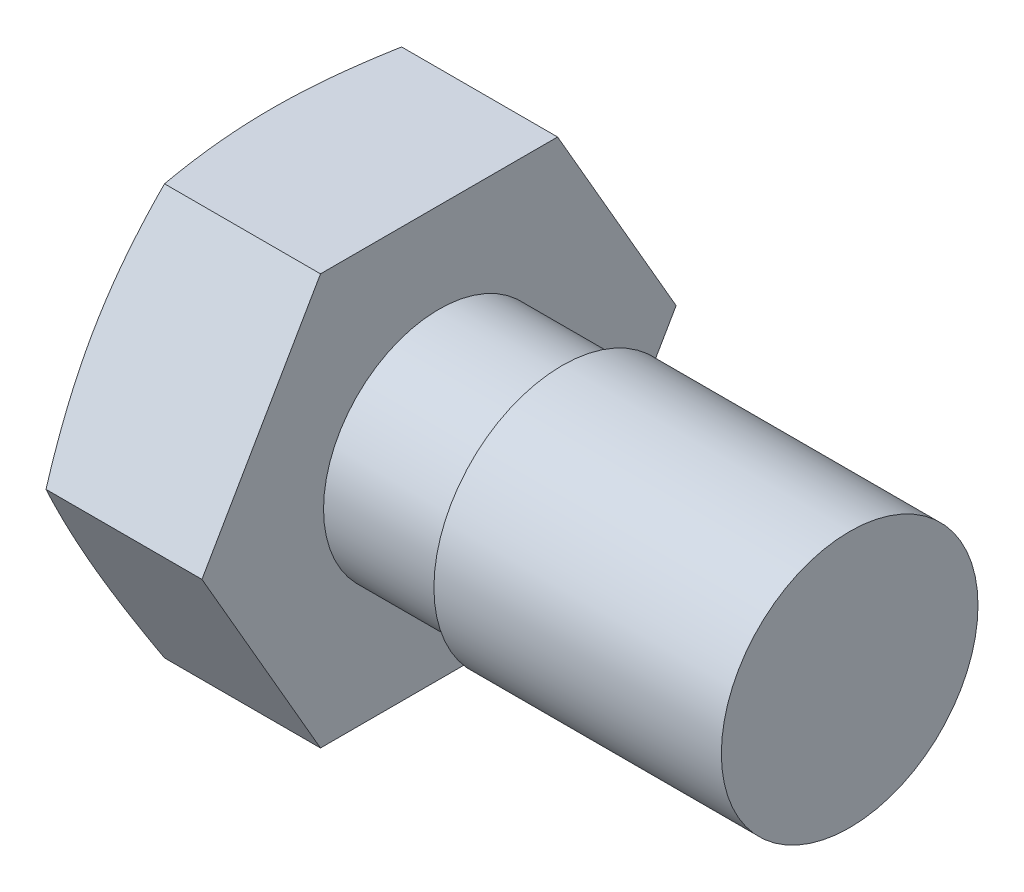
ISO-10303-21;
HEADER;
FILE_DESCRIPTION(('STEP AP214'),'2;1');
FILE_NAME('part.step','',(''),(''),'','','');
FILE_SCHEMA(('AUTOMOTIVE_DESIGN { 1 0 10303 214 1 1 1 1 }'));
ENDSEC;
DATA;
#1=APPLICATION_CONTEXT('core data for automotive mechanical design processes');
#2=APPLICATION_PROTOCOL_DEFINITION('international standard','automotive_design',2000,#1);
#3=PRODUCT_CONTEXT('',#1,'mechanical');
#4=PRODUCT('Part','Part','',(#3));
#5=PRODUCT_RELATED_PRODUCT_CATEGORY('part','',(#4));
#6=PRODUCT_DEFINITION_FORMATION('','',#4);
#7=PRODUCT_DEFINITION_CONTEXT('part definition',#1,'design');
#8=PRODUCT_DEFINITION('design','',#6,#7);
#9=PRODUCT_DEFINITION_SHAPE('','',#8);
#10=(LENGTH_UNIT() NAMED_UNIT(*) SI_UNIT(.MILLI.,.METRE.));
#11=(NAMED_UNIT(*) PLANE_ANGLE_UNIT() SI_UNIT($,.RADIAN.));
#12=(NAMED_UNIT(*) SI_UNIT($,.STERADIAN.) SOLID_ANGLE_UNIT());
#13=UNCERTAINTY_MEASURE_WITH_UNIT(LENGTH_MEASURE(1.E-05),#10,'distance_accuracy_value','');
#14=(GEOMETRIC_REPRESENTATION_CONTEXT(3) GLOBAL_UNCERTAINTY_ASSIGNED_CONTEXT((#13)) GLOBAL_UNIT_ASSIGNED_CONTEXT((#10,
#11,#12)) REPRESENTATION_CONTEXT('',''));
#15=CARTESIAN_POINT('',(0.,0.,0.));
#16=DIRECTION('',(0.,0.,1.));
#17=DIRECTION('',(1.,0.,0.));
#18=AXIS2_PLACEMENT_3D('',#15,#16,#17);
#19=CARTESIAN_POINT('',(1.2,0.,0.));
#20=DIRECTION('',(-1.,0.,0.));
#21=DIRECTION('',(0.,0.,1.));
#22=AXIS2_PLACEMENT_3D('',#19,#20,#21);
#23=PLANE('',#22);
#24=CARTESIAN_POINT('',(1.2,0.,0.));
#25=DIRECTION('',(-1.,0.,0.));
#26=DIRECTION('',(0.,0.,1.));
#27=AXIS2_PLACEMENT_3D('',#24,#25,#26);
#28=CIRCLE('',#27,3.35);
#29=CARTESIAN_POINT('',(1.2,0.,3.35));
#30=VERTEX_POINT('',#29);
#31=EDGE_CURVE('E231',#30,#30,#28,.T.);
#32=ORIENTED_EDGE('',*,*,#31,.T.);
#33=EDGE_LOOP('',(#32));
#34=FACE_BOUND('',#33,.T.);
#35=DIRECTION('',(0.,0.,-1.));
#36=VECTOR('',#35,1.);
#37=CARTESIAN_POINT('',(1.2,2.4,0.));
#38=LINE('',#37,#36);
#39=CARTESIAN_POINT('',(1.2,2.4,0.545999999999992));
#40=VERTEX_POINT('',#39);
#41=CARTESIAN_POINT('',(1.2,2.4,-0.546000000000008));
#42=VERTEX_POINT('',#41);
#43=EDGE_CURVE('E202',#40,#42,#38,.T.);
#44=ORIENTED_EDGE('',*,*,#43,.F.);
#45=DIRECTION('',(0.,-1.,0.));
#46=VECTOR('',#45,1.);
#47=CARTESIAN_POINT('',(1.2,0.,0.546));
#48=LINE('',#47,#46);
#49=CARTESIAN_POINT('',(1.2,0.546,0.545999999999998));
#50=VERTEX_POINT('',#49);
#51=EDGE_CURVE('E191',#40,#50,#48,.T.);
#52=ORIENTED_EDGE('',*,*,#51,.T.);
#53=DIRECTION('',(0.,0.,-1.));
#54=VECTOR('',#53,1.);
#55=CARTESIAN_POINT('',(1.2,0.546,0.));
#56=LINE('',#55,#54);
#57=CARTESIAN_POINT('',(1.2,0.546,2.4));
#58=VERTEX_POINT('',#57);
#59=EDGE_CURVE('E416',#58,#50,#56,.T.);
#60=ORIENTED_EDGE('',*,*,#59,.F.);
#61=DIRECTION('',(0.,1.,0.));
#62=VECTOR('',#61,1.);
#63=CARTESIAN_POINT('',(1.2,0.,2.4));
#64=LINE('',#63,#62);
#65=CARTESIAN_POINT('',(1.2,-0.546,2.4));
#66=VERTEX_POINT('',#65);
#67=EDGE_CURVE('E400',#66,#58,#64,.T.);
#68=ORIENTED_EDGE('',*,*,#67,.F.);
#69=DIRECTION('',(0.,0.,-1.));
#70=VECTOR('',#69,1.);
#71=CARTESIAN_POINT('',(1.2,-0.546,0.));
#72=LINE('',#71,#70);
#73=CARTESIAN_POINT('',(1.2,-0.546,0.546000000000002));
#74=VERTEX_POINT('',#73);
#75=EDGE_CURVE('E394',#66,#74,#72,.T.);
#76=ORIENTED_EDGE('',*,*,#75,.T.);
#77=CARTESIAN_POINT('',(1.2,-2.4,0.546000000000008));
#78=VERTEX_POINT('',#77);
#79=EDGE_CURVE('E195',#74,#78,#48,.T.);
#80=ORIENTED_EDGE('',*,*,#79,.T.);
#81=DIRECTION('',(0.,0.,1.));
#82=VECTOR('',#81,1.);
#83=CARTESIAN_POINT('',(1.2,-2.4,0.));
#84=LINE('',#83,#82);
#85=CARTESIAN_POINT('',(1.2,-2.4,-0.545999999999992));
#86=VERTEX_POINT('',#85);
#87=EDGE_CURVE('E208',#86,#78,#84,.T.);
#88=ORIENTED_EDGE('',*,*,#87,.F.);
#89=DIRECTION('',(0.,-1.,0.));
#90=VECTOR('',#89,1.);
#91=CARTESIAN_POINT('',(1.2,0.,-0.546));
#92=LINE('',#91,#90);
#93=CARTESIAN_POINT('',(1.2,-0.546,-0.545999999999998));
#94=VERTEX_POINT('',#93);
#95=EDGE_CURVE('E186',#94,#86,#92,.T.);
#96=ORIENTED_EDGE('',*,*,#95,.F.);
#97=CARTESIAN_POINT('',(1.2,-0.546,-2.4));
#98=VERTEX_POINT('',#97);
#99=EDGE_CURVE('E402',#94,#98,#72,.T.);
#100=ORIENTED_EDGE('',*,*,#99,.T.);
#101=DIRECTION('',(0.,-1.,0.));
#102=VECTOR('',#101,1.);
#103=CARTESIAN_POINT('',(1.2,0.,-2.4));
#104=LINE('',#103,#102);
#105=CARTESIAN_POINT('',(1.2,0.546,-2.4));
#106=VERTEX_POINT('',#105);
#107=EDGE_CURVE('E418',#106,#98,#104,.T.);
#108=ORIENTED_EDGE('',*,*,#107,.F.);
#109=CARTESIAN_POINT('',(1.2,0.546,-0.546000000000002));
#110=VERTEX_POINT('',#109);
#111=EDGE_CURVE('E419',#110,#106,#56,.T.);
#112=ORIENTED_EDGE('',*,*,#111,.F.);
#113=EDGE_CURVE('E183',#42,#110,#92,.T.);
#114=ORIENTED_EDGE('',*,*,#113,.F.);
#115=EDGE_LOOP('',(#44,#52,#60,#68,#76,#80,#88,#96,#100,#108,#112,#114));
#116=FACE_BOUND('',#115,.T.);
#117=ADVANCED_FACE('F34',(#34,#116),#23,.T.);
#118=CARTESIAN_POINT('',(0.700000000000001,-0.546,2.83956043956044));
#119=DIRECTION('',(0.660255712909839,0.,0.751040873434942));
#120=DIRECTION('',(0.751040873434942,0.,-0.660255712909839));
#121=AXIS2_PLACEMENT_3D('',#118,#119,#120);
#122=PLANE('',#121);
#123=DIRECTION('',(0.,1.,0.));
#124=VECTOR('',#123,1.);
#125=CARTESIAN_POINT('',(3.308925,-0.546000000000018,0.546000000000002));
#126=LINE('',#125,#124);
#127=CARTESIAN_POINT('',(3.308925,-0.546,0.546000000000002));
#128=VERTEX_POINT('',#127);
#129=CARTESIAN_POINT('',(3.308925,0.546,0.545999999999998));
#130=VERTEX_POINT('',#129);
#131=EDGE_CURVE('E188',#128,#130,#126,.T.);
#132=ORIENTED_EDGE('',*,*,#131,.F.);
#133=DIRECTION('',(0.751040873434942,0.,-0.660255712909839));
#134=VECTOR('',#133,1.);
#135=CARTESIAN_POINT('',(0.700000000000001,-0.546,2.83956043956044));
#136=LINE('',#135,#134);
#137=EDGE_CURVE('E218',#66,#128,#136,.T.);
#138=ORIENTED_EDGE('',*,*,#137,.F.);
#139=ORIENTED_EDGE('',*,*,#67,.T.);
#140=DIRECTION('',(0.751040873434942,0.,-0.660255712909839));
#141=VECTOR('',#140,1.);
#142=CARTESIAN_POINT('',(0.700000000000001,0.546,2.83956043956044));
#143=LINE('',#142,#141);
#144=EDGE_CURVE('E211',#58,#130,#143,.T.);
#145=ORIENTED_EDGE('',*,*,#144,.T.);
#146=EDGE_LOOP('',(#132,#138,#139,#145));
#147=FACE_BOUND('',#146,.T.);
#148=ADVANCED_FACE('F310',(#147),#122,.F.);
#149=CARTESIAN_POINT('',(3.93,-0.546,0.));
#150=DIRECTION('',(0.,1.,0.));
#151=DIRECTION('',(0.,0.,1.));
#152=AXIS2_PLACEMENT_3D('',#149,#150,#151);
#153=PLANE('',#152);
#154=ORIENTED_EDGE('',*,*,#137,.T.);
#155=DIRECTION('',(-1.,0.,0.));
#156=VECTOR('',#155,1.);
#157=CARTESIAN_POINT('',(3.93,-0.546,0.546000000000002));
#158=LINE('',#157,#156);
#159=EDGE_CURVE('E194',#128,#74,#158,.T.);
#160=ORIENTED_EDGE('',*,*,#159,.T.);
#161=ORIENTED_EDGE('',*,*,#75,.F.);
#162=EDGE_LOOP('',(#154,#160,#161));
#163=FACE_BOUND('',#162,.T.);
#164=ADVANCED_FACE('F315',(#163),#153,.T.);
#165=CARTESIAN_POINT('',(3.93,0.546,0.));
#166=DIRECTION('',(0.,1.,0.));
#167=DIRECTION('',(0.,0.,1.));
#168=AXIS2_PLACEMENT_3D('',#165,#166,#167);
#169=PLANE('',#168);
#170=DIRECTION('',(-1.,0.,0.));
#171=VECTOR('',#170,1.);
#172=CARTESIAN_POINT('',(3.93,0.546,0.545999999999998));
#173=LINE('',#172,#171);
#174=EDGE_CURVE('E43',#130,#50,#173,.T.);
#175=ORIENTED_EDGE('',*,*,#174,.F.);
#176=ORIENTED_EDGE('',*,*,#144,.F.);
#177=ORIENTED_EDGE('',*,*,#59,.T.);
#178=EDGE_LOOP('',(#175,#176,#177));
#179=FACE_BOUND('',#178,.T.);
#180=ADVANCED_FACE('F340',(#179),#169,.F.);
#181=CARTESIAN_POINT('',(3.5,-4.,2.3094010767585));
#182=DIRECTION('',(0.,1.,0.));
#183=DIRECTION('',(0.,0.,1.));
#184=AXIS2_PLACEMENT_3D('',#181,#182,#183);
#185=PLANE('',#184);
#186=CARTESIAN_POINT('',(1.43324420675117,-4.,-6.09197157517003));
#187=CARTESIAN_POINT('',(1.37826794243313,-4.,-5.91122476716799));
#188=CARTESIAN_POINT('',(1.32393819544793,-4.,-5.73027762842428));
#189=CARTESIAN_POINT('',(1.21692947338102,-4.,-5.36788074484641));
#190=CARTESIAN_POINT('',(1.16425063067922,-4.,-5.18643096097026));
#191=CARTESIAN_POINT('',(1.06081246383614,-4.,-4.82261138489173));
#192=CARTESIAN_POINT('',(1.01005696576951,-4.,-4.64024050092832));
#193=CARTESIAN_POINT('',(0.911065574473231,-4.,-4.27481713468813));
#194=CARTESIAN_POINT('',(0.862829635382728,-4.,-4.09176466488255));
#195=CARTESIAN_POINT('',(0.770086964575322,-4.,-3.72715987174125));
#196=CARTESIAN_POINT('',(0.725541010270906,-4.,-3.54561757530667));
#197=CARTESIAN_POINT('',(0.640278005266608,-4.,-3.18163638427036));
#198=CARTESIAN_POINT('',(0.599560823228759,-4.,-2.99919752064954));
#199=CARTESIAN_POINT('',(0.52290830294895,-4.,-2.6333725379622));
#200=CARTESIAN_POINT('',(0.486971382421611,-4.,-2.44998675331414));
#201=CARTESIAN_POINT('',(0.420981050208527,-4.,-2.08215175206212));
#202=CARTESIAN_POINT('',(0.390927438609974,-4.,-1.89770257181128));
#203=CARTESIAN_POINT('',(0.340906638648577,-4.,-1.54854487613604));
#204=CARTESIAN_POINT('',(0.320185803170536,-4.,-1.38394534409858));
#205=CARTESIAN_POINT('',(0.285186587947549,-4.,-1.05406613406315));
#206=CARTESIAN_POINT('',(0.270907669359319,-4.,-0.888786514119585));
#207=CARTESIAN_POINT('',(0.249478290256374,-4.,-0.557869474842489));
#208=CARTESIAN_POINT('',(0.242323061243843,-4.,-0.392232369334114));
#209=CARTESIAN_POINT('',(0.235503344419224,-4.,-0.0608023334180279));
#210=CARTESIAN_POINT('',(0.235838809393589,-4.,0.104990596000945));
#211=CARTESIAN_POINT('',(0.244003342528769,-4.,0.437250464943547));
#212=CARTESIAN_POINT('',(0.251871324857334,-4.,0.603716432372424));
#213=CARTESIAN_POINT('',(0.274739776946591,-4.,0.936153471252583));
#214=CARTESIAN_POINT('',(0.289740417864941,-4.,1.10212453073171));
#215=CARTESIAN_POINT('',(0.326177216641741,-4.,1.4334923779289));
#216=CARTESIAN_POINT('',(0.347618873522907,-4.,1.59888855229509));
#217=CARTESIAN_POINT('',(0.39607457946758,-4.,1.92885323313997));
#218=CARTESIAN_POINT('',(0.423088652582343,-4.,2.09342173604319));
#219=CARTESIAN_POINT('',(0.483755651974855,-4.,2.43254696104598));
#220=CARTESIAN_POINT('',(0.517729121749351,-4.,2.60704584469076));
#221=CARTESIAN_POINT('',(0.590053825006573,-4.,2.95513980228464));
#222=CARTESIAN_POINT('',(0.628405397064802,-4.,3.12873480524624));
#223=CARTESIAN_POINT('',(0.708669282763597,-4.,3.47514388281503));
#224=CARTESIAN_POINT('',(0.750582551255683,-4.,3.64795773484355));
#225=CARTESIAN_POINT('',(0.837290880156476,-4.,3.99286324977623));
#226=CARTESIAN_POINT('',(0.882086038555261,-4.,4.1649548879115));
#227=CARTESIAN_POINT('',(1.02006424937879,-4.,4.68073114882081));
#228=CARTESIAN_POINT('',(1.11673589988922,-4.,5.02348100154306));
#229=CARTESIAN_POINT('',(1.31623070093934,-4.,5.70710132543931));
#230=CARTESIAN_POINT('',(1.41905285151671,-4.,6.04797209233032));
#231=CARTESIAN_POINT('',(1.6277325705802,-4.,6.72443046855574));
#232=CARTESIAN_POINT('',(1.73354079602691,-4.,7.0600333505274));
#233=CARTESIAN_POINT('',(1.9481246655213,-4.,7.73030367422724));
#234=CARTESIAN_POINT('',(2.05690045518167,-4.,8.06497106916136));
#235=CARTESIAN_POINT('',(2.27619323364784,-4.,8.73231717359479));
#236=CARTESIAN_POINT('',(2.38670198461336,-4.,9.06499859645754));
#237=CARTESIAN_POINT('',(2.60935288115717,-4.,9.72978420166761));
#238=CARTESIAN_POINT('',(2.72149489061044,-4.,10.0618884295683));
#239=CARTESIAN_POINT('',(2.83420727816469,-4.,10.3937961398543));
#240=B_SPLINE_CURVE_WITH_KNOTS('',3,(#186,#187,#188,#189,#190,#191,#192,#193,#194,#195,#196,
#197,#198,#199,#200,#201,#202,#203,#204,#205,#206,#207,#208,#209,#210,#211,#212,#213,#214,#215,
#216,#217,#218,#219,#220,#221,#222,#223,#224,#225,#226,#227,#228,#229,#230,#231,#232,#233,#234,
#235,#236,#237,#238,#239),.UNSPECIFIED.,.F.,.F.,(4,2,2,2,2,2,2,2,2,2,2,2,2,2,2,2,2,2,2,2,2,2,2,
2,2,2,4),(0.,0.566772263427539,1.13358985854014,1.70148141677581,2.26936263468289,
2.83011281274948,3.39084374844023,3.95138861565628,4.51191443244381,5.00950049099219,
5.50704492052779,6.00425607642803,6.50146409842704,7.00125471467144,7.50105732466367,
8.00128786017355,8.50152055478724,9.034777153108,9.5680750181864,10.1015163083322,
10.6349757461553,11.7032392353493,12.7713295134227,13.8269715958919,14.882665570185,
15.9343271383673,16.9859015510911),.UNSPECIFIED.);
#241=CARTESIAN_POINT('',(0.461806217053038,-4.,-2.3094010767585));
#242=VERTEX_POINT('',#241);
#243=CARTESIAN_POINT('',(0.461806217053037,-4.,2.3094010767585));
#244=VERTEX_POINT('',#243);
#245=EDGE_CURVE('E282',#242,#244,#240,.T.);
#246=ORIENTED_EDGE('',*,*,#245,.F.);
#247=DIRECTION('',(-1.,0.,0.));
#248=VECTOR('',#247,1.);
#249=CARTESIAN_POINT('',(3.5,-4.,-2.3094010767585));
#250=LINE('',#249,#248);
#251=CARTESIAN_POINT('',(3.5,-4.,-2.3094010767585));
#252=VERTEX_POINT('',#251);
#253=EDGE_CURVE('E427',#252,#242,#250,.T.);
#254=ORIENTED_EDGE('',*,*,#253,.F.);
#255=DIRECTION('',(0.,0.,-1.));
#256=VECTOR('',#255,1.);
#257=CARTESIAN_POINT('',(3.5,-4.,2.3094010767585));
#258=LINE('',#257,#256);
#259=CARTESIAN_POINT('',(3.5,-4.,2.3094010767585));
#260=VERTEX_POINT('',#259);
#261=EDGE_CURVE('E455',#260,#252,#258,.T.);
#262=ORIENTED_EDGE('',*,*,#261,.F.);
#263=DIRECTION('',(-1.,0.,0.));
#264=VECTOR('',#263,1.);
#265=CARTESIAN_POINT('',(3.5,-4.,2.3094010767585));
#266=LINE('',#265,#264);
#267=EDGE_CURVE('E442',#260,#244,#266,.T.);
#268=ORIENTED_EDGE('',*,*,#267,.T.);
#269=EDGE_LOOP('',(#246,#254,#262,#268));
#270=FACE_BOUND('',#269,.T.);
#271=ADVANCED_FACE('F36',(#270),#185,.F.);
#272=CARTESIAN_POINT('',(3.5,-4.,-2.3094010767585));
#273=DIRECTION('',(0.,0.5,0.866025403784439));
#274=DIRECTION('',(0.,-0.866025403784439,0.5));
#275=AXIS2_PLACEMENT_3D('',#272,#273,#274);
#276=PLANE('',#275);
#277=CARTESIAN_POINT('',(0.461848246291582,0.000200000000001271,-4.61891762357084));
#278=CARTESIAN_POINT('',(0.427021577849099,-0.165465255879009,-4.52327074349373));
#279=CARTESIAN_POINT('',(0.39534061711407,-0.331676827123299,-4.42730844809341));
#280=CARTESIAN_POINT('',(0.339602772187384,-0.665180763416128,-4.23475986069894));
#281=CARTESIAN_POINT('',(0.315551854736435,-0.832473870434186,-4.1381731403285));
#282=CARTESIAN_POINT('',(0.276650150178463,-1.16628418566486,-3.9454476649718));
#283=CARTESIAN_POINT('',(0.261714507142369,-1.33279376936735,-3.84931331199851));
#284=CARTESIAN_POINT('',(0.241681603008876,-1.66620234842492,-3.65681977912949));
#285=CARTESIAN_POINT('',(0.236580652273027,-1.83310117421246,-3.56046069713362));
#286=CARTESIAN_POINT('',(0.236580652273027,-2.16689882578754,-3.36774253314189));
#287=CARTESIAN_POINT('',(0.241681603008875,-2.33379765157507,-3.27138345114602));
#288=CARTESIAN_POINT('',(0.261714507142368,-2.66720623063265,-3.078889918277));
#289=CARTESIAN_POINT('',(0.276650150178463,-2.83371581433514,-2.98275556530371));
#290=CARTESIAN_POINT('',(0.315551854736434,-3.16752612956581,-2.79003008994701));
#291=CARTESIAN_POINT('',(0.339602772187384,-3.33481923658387,-2.69344336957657));
#292=CARTESIAN_POINT('',(0.39534061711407,-3.6683231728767,-2.5008947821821));
#293=CARTESIAN_POINT('',(0.427021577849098,-3.83453474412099,-2.40493248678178));
#294=CARTESIAN_POINT('',(0.461848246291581,-4.0002,-2.30928560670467));
#295=B_SPLINE_CURVE_WITH_KNOTS('',3,(#277,#278,#279,#280,#281,#282,#283,#284,#285,#286,#287,
#288,#289,#290,#291,#292,#293,#294),.UNSPECIFIED.,.F.,.F.,(4,2,2,2,2,2,2,2,4),(0.,
0.583374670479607,1.16720442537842,1.74551281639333,2.32360420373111,2.90169559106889,
3.4800039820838,4.06383373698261,4.64720840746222),.UNSPECIFIED.);
#296=CARTESIAN_POINT('',(0.461806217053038,0.,-4.61880215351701));
#297=VERTEX_POINT('',#296);
#298=EDGE_CURVE('E278',#297,#242,#295,.T.);
#299=ORIENTED_EDGE('',*,*,#298,.F.);
#300=DIRECTION('',(-1.,0.,0.));
#301=VECTOR('',#300,1.);
#302=CARTESIAN_POINT('',(3.5,0.,-4.61880215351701));
#303=LINE('',#302,#301);
#304=CARTESIAN_POINT('',(3.5,0.,-4.61880215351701));
#305=VERTEX_POINT('',#304);
#306=EDGE_CURVE('E430',#305,#297,#303,.T.);
#307=ORIENTED_EDGE('',*,*,#306,.F.);
#308=DIRECTION('',(0.,0.866025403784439,-0.5));
#309=VECTOR('',#308,1.);
#310=CARTESIAN_POINT('',(3.5,-4.,-2.3094010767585));
#311=LINE('',#310,#309);
#312=EDGE_CURVE('E453',#252,#305,#311,.T.);
#313=ORIENTED_EDGE('',*,*,#312,.F.);
#314=ORIENTED_EDGE('',*,*,#253,.T.);
#315=EDGE_LOOP('',(#299,#307,#313,#314));
#316=FACE_BOUND('',#315,.T.);
#317=ADVANCED_FACE('F287',(#316),#276,.F.);
#318=CARTESIAN_POINT('',(3.5,0.,-4.61880215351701));
#319=DIRECTION('',(0.,-0.5,0.866025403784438));
#320=DIRECTION('',(0.,-0.866025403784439,-0.5));
#321=AXIS2_PLACEMENT_3D('',#318,#319,#320);
#322=PLANE('',#321);
#323=CARTESIAN_POINT('',(0.461848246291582,4.0002,-2.30928560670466));
#324=CARTESIAN_POINT('',(0.427021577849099,3.83453474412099,-2.40493248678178));
#325=CARTESIAN_POINT('',(0.39534061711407,3.6683231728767,-2.5008947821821));
#326=CARTESIAN_POINT('',(0.339602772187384,3.33481923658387,-2.69344336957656));
#327=CARTESIAN_POINT('',(0.315551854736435,3.16752612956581,-2.79003008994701));
#328=CARTESIAN_POINT('',(0.276650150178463,2.83371581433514,-2.98275556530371));
#329=CARTESIAN_POINT('',(0.261714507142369,2.66720623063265,-3.078889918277));
#330=CARTESIAN_POINT('',(0.241681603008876,2.33379765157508,-3.27138345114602));
#331=CARTESIAN_POINT('',(0.236580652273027,2.16689882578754,-3.36774253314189));
#332=CARTESIAN_POINT('',(0.236580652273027,1.83310117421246,-3.56046069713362));
#333=CARTESIAN_POINT('',(0.241681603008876,1.66620234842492,-3.65681977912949));
#334=CARTESIAN_POINT('',(0.261714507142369,1.33279376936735,-3.84931331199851));
#335=CARTESIAN_POINT('',(0.276650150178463,1.16628418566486,-3.9454476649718));
#336=CARTESIAN_POINT('',(0.315551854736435,0.832473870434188,-4.1381731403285));
#337=CARTESIAN_POINT('',(0.339602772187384,0.66518076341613,-4.23475986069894));
#338=CARTESIAN_POINT('',(0.395340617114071,0.331676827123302,-4.42730844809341));
#339=CARTESIAN_POINT('',(0.427021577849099,0.165465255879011,-4.52327074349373));
#340=CARTESIAN_POINT('',(0.461848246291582,-0.000199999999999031,-4.61891762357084));
#341=B_SPLINE_CURVE_WITH_KNOTS('',3,(#323,#324,#325,#326,#327,#328,#329,#330,#331,#332,#333,
#334,#335,#336,#337,#338,#339,#340),.UNSPECIFIED.,.F.,.F.,(4,2,2,2,2,2,2,2,4),(0.,
0.583374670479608,1.16720442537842,1.74551281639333,2.32360420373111,2.90169559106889,
3.4800039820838,4.06383373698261,4.64720840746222),.UNSPECIFIED.);
#342=CARTESIAN_POINT('',(0.461806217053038,4.,-2.3094010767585));
#343=VERTEX_POINT('',#342);
#344=EDGE_CURVE('E272',#343,#297,#341,.T.);
#345=ORIENTED_EDGE('',*,*,#344,.F.);
#346=DIRECTION('',(-1.,0.,0.));
#347=VECTOR('',#346,1.);
#348=CARTESIAN_POINT('',(3.5,4.,-2.3094010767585));
#349=LINE('',#348,#347);
#350=CARTESIAN_POINT('',(3.5,4.,-2.3094010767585));
#351=VERTEX_POINT('',#350);
#352=EDGE_CURVE('E433',#351,#343,#349,.T.);
#353=ORIENTED_EDGE('',*,*,#352,.F.);
#354=DIRECTION('',(0.,0.866025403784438,0.5));
#355=VECTOR('',#354,1.);
#356=CARTESIAN_POINT('',(3.5,0.,-4.61880215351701));
#357=LINE('',#356,#355);
#358=EDGE_CURVE('E451',#305,#351,#357,.T.);
#359=ORIENTED_EDGE('',*,*,#358,.F.);
#360=ORIENTED_EDGE('',*,*,#306,.T.);
#361=EDGE_LOOP('',(#345,#353,#359,#360));
#362=FACE_BOUND('',#361,.T.);
#363=ADVANCED_FACE('F290',(#362),#322,.F.);
#364=CARTESIAN_POINT('',(3.5,4.,-2.3094010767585));
#365=DIRECTION('',(0.,-1.,0.));
#366=DIRECTION('',(0.,0.,-1.));
#367=AXIS2_PLACEMENT_3D('',#364,#365,#366);
#368=PLANE('',#367);
#369=CARTESIAN_POINT('',(1.43324420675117,4.,-6.09197157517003));
#370=CARTESIAN_POINT('',(1.37826794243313,4.,-5.91122476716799));
#371=CARTESIAN_POINT('',(1.32393819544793,4.,-5.73027762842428));
#372=CARTESIAN_POINT('',(1.21692947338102,4.,-5.36788074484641));
#373=CARTESIAN_POINT('',(1.16425063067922,4.,-5.18643096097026));
#374=CARTESIAN_POINT('',(1.06081246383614,4.,-4.82261138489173));
#375=CARTESIAN_POINT('',(1.01005696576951,4.,-4.64024050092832));
#376=CARTESIAN_POINT('',(0.911065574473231,4.,-4.27481713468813));
#377=CARTESIAN_POINT('',(0.862829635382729,4.,-4.09176466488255));
#378=CARTESIAN_POINT('',(0.770086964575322,4.,-3.72715987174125));
#379=CARTESIAN_POINT('',(0.725541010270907,4.,-3.54561757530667));
#380=CARTESIAN_POINT('',(0.640278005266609,4.,-3.18163638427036));
#381=CARTESIAN_POINT('',(0.59956082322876,4.,-2.99919752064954));
#382=CARTESIAN_POINT('',(0.522908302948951,4.,-2.6333725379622));
#383=CARTESIAN_POINT('',(0.486971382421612,4.,-2.44998675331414));
#384=CARTESIAN_POINT('',(0.420981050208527,4.,-2.08215175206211));
#385=CARTESIAN_POINT('',(0.390927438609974,4.,-1.89770257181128));
#386=CARTESIAN_POINT('',(0.340906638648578,4.,-1.54854487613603));
#387=CARTESIAN_POINT('',(0.320185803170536,4.,-1.38394534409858));
#388=CARTESIAN_POINT('',(0.28518658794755,4.,-1.05406613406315));
#389=CARTESIAN_POINT('',(0.270907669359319,4.,-0.888786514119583));
#390=CARTESIAN_POINT('',(0.249478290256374,4.,-0.557869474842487));
#391=CARTESIAN_POINT('',(0.242323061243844,4.,-0.392232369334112));
#392=CARTESIAN_POINT('',(0.235503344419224,4.,-0.0608023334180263));
#393=CARTESIAN_POINT('',(0.23583880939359,4.,0.104990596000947));
#394=CARTESIAN_POINT('',(0.24400334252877,4.,0.437250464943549));
#395=CARTESIAN_POINT('',(0.251871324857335,4.,0.603716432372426));
#396=CARTESIAN_POINT('',(0.274739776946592,4.,0.936153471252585));
#397=CARTESIAN_POINT('',(0.289740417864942,4.,1.10212453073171));
#398=CARTESIAN_POINT('',(0.326177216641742,4.,1.4334923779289));
#399=CARTESIAN_POINT('',(0.347618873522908,4.,1.59888855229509));
#400=CARTESIAN_POINT('',(0.396074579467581,4.,1.92885323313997));
#401=CARTESIAN_POINT('',(0.423088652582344,4.,2.09342173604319));
#402=CARTESIAN_POINT('',(0.483755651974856,4.,2.43254696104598));
#403=CARTESIAN_POINT('',(0.517729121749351,4.,2.60704584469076));
#404=CARTESIAN_POINT('',(0.590053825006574,4.,2.95513980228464));
#405=CARTESIAN_POINT('',(0.628405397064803,4.,3.12873480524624));
#406=CARTESIAN_POINT('',(0.708669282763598,4.,3.47514388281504));
#407=CARTESIAN_POINT('',(0.750582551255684,4.,3.64795773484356));
#408=CARTESIAN_POINT('',(0.837290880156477,4.,3.99286324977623));
#409=CARTESIAN_POINT('',(0.882086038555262,4.,4.1649548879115));
#410=CARTESIAN_POINT('',(1.02006424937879,4.,4.68073114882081));
#411=CARTESIAN_POINT('',(1.11673589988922,4.,5.02348100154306));
#412=CARTESIAN_POINT('',(1.31623070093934,4.,5.70710132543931));
#413=CARTESIAN_POINT('',(1.41905285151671,4.,6.04797209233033));
#414=CARTESIAN_POINT('',(1.6277325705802,4.,6.72443046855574));
#415=CARTESIAN_POINT('',(1.73354079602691,4.,7.0600333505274));
#416=CARTESIAN_POINT('',(1.9481246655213,4.,7.73030367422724));
#417=CARTESIAN_POINT('',(2.05690045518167,4.,8.06497106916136));
#418=CARTESIAN_POINT('',(2.27619323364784,4.,8.73231717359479));
#419=CARTESIAN_POINT('',(2.38670198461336,4.,9.06499859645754));
#420=CARTESIAN_POINT('',(2.60935288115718,4.,9.72978420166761));
#421=CARTESIAN_POINT('',(2.72149489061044,4.,10.0618884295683));
#422=CARTESIAN_POINT('',(2.83420727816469,4.,10.3937961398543));
#423=B_SPLINE_CURVE_WITH_KNOTS('',3,(#369,#370,#371,#372,#373,#374,#375,#376,#377,#378,#379,
#380,#381,#382,#383,#384,#385,#386,#387,#388,#389,#390,#391,#392,#393,#394,#395,#396,#397,#398,
#399,#400,#401,#402,#403,#404,#405,#406,#407,#408,#409,#410,#411,#412,#413,#414,#415,#416,#417,
#418,#419,#420,#421,#422),.UNSPECIFIED.,.F.,.F.,(4,2,2,2,2,2,2,2,2,2,2,2,2,2,2,2,2,2,2,2,2,2,2,
2,2,2,4),(0.,0.566772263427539,1.13358985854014,1.70148141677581,2.26936263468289,
2.83011281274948,3.39084374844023,3.95138861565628,4.51191443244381,5.0095004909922,
5.50704492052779,6.00425607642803,6.50146409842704,7.00125471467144,7.50105732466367,
8.00128786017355,8.50152055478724,9.034777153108,9.5680750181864,10.1015163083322,
10.6349757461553,11.7032392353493,12.7713295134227,13.8269715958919,14.882665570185,
15.9343271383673,16.9859015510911),.UNSPECIFIED.);
#424=CARTESIAN_POINT('',(0.461806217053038,4.,2.30940107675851));
#425=VERTEX_POINT('',#424);
#426=EDGE_CURVE('E266',#425,#343,#423,.F.);
#427=ORIENTED_EDGE('',*,*,#426,.F.);
#428=DIRECTION('',(-1.,0.,0.));
#429=VECTOR('',#428,1.);
#430=CARTESIAN_POINT('',(3.5,4.,2.3094010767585));
#431=LINE('',#430,#429);
#432=CARTESIAN_POINT('',(3.5,4.,2.3094010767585));
#433=VERTEX_POINT('',#432);
#434=EDGE_CURVE('E436',#433,#425,#431,.T.);
#435=ORIENTED_EDGE('',*,*,#434,.F.);
#436=DIRECTION('',(0.,0.,1.));
#437=VECTOR('',#436,1.);
#438=CARTESIAN_POINT('',(3.5,4.,-2.3094010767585));
#439=LINE('',#438,#437);
#440=EDGE_CURVE('E449',#351,#433,#439,.T.);
#441=ORIENTED_EDGE('',*,*,#440,.F.);
#442=ORIENTED_EDGE('',*,*,#352,.T.);
#443=EDGE_LOOP('',(#427,#435,#441,#442));
#444=FACE_BOUND('',#443,.T.);
#445=ADVANCED_FACE('F294',(#444),#368,.F.);
#446=CARTESIAN_POINT('',(3.5,4.,2.3094010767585));
#447=DIRECTION('',(0.,-0.5,-0.866025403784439));
#448=DIRECTION('',(0.,0.866025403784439,-0.5));
#449=AXIS2_PLACEMENT_3D('',#446,#447,#448);
#450=PLANE('',#449);
#451=CARTESIAN_POINT('',(0.461848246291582,-0.000199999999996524,4.61891762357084));
#452=CARTESIAN_POINT('',(0.427021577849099,0.165465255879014,4.52327074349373));
#453=CARTESIAN_POINT('',(0.39534061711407,0.331676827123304,4.42730844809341));
#454=CARTESIAN_POINT('',(0.339602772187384,0.665180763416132,4.23475986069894));
#455=CARTESIAN_POINT('',(0.315551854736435,0.83247387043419,4.1381731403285));
#456=CARTESIAN_POINT('',(0.276650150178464,1.16628418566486,3.9454476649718));
#457=CARTESIAN_POINT('',(0.261714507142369,1.33279376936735,3.84931331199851));
#458=CARTESIAN_POINT('',(0.241681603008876,1.66620234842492,3.65681977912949));
#459=CARTESIAN_POINT('',(0.236580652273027,1.83310117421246,3.56046069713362));
#460=CARTESIAN_POINT('',(0.236580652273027,2.16689882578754,3.36774253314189));
#461=CARTESIAN_POINT('',(0.241681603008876,2.33379765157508,3.27138345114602));
#462=CARTESIAN_POINT('',(0.261714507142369,2.66720623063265,3.078889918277));
#463=CARTESIAN_POINT('',(0.276650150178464,2.83371581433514,2.98275556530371));
#464=CARTESIAN_POINT('',(0.315551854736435,3.16752612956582,2.79003008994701));
#465=CARTESIAN_POINT('',(0.339602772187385,3.33481923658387,2.69344336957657));
#466=CARTESIAN_POINT('',(0.395340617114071,3.6683231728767,2.5008947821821));
#467=CARTESIAN_POINT('',(0.427021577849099,3.83453474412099,2.40493248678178));
#468=CARTESIAN_POINT('',(0.461848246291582,4.0002,2.30928560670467));
#469=B_SPLINE_CURVE_WITH_KNOTS('',3,(#451,#452,#453,#454,#455,#456,#457,#458,#459,#460,#461,
#462,#463,#464,#465,#466,#467,#468),.UNSPECIFIED.,.F.,.F.,(4,2,2,2,2,2,2,2,4),(0.,
0.583374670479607,1.16720442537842,1.74551281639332,2.32360420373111,2.90169559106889,
3.4800039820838,4.06383373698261,4.64720840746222),.UNSPECIFIED.);
#470=CARTESIAN_POINT('',(0.461806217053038,0.,4.61880215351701));
#471=VERTEX_POINT('',#470);
#472=EDGE_CURVE('E241',#471,#425,#469,.T.);
#473=ORIENTED_EDGE('',*,*,#472,.F.);
#474=DIRECTION('',(-1.,0.,0.));
#475=VECTOR('',#474,1.);
#476=CARTESIAN_POINT('',(3.5,0.,4.61880215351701));
#477=LINE('',#476,#475);
#478=CARTESIAN_POINT('',(3.5,0.,4.61880215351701));
#479=VERTEX_POINT('',#478);
#480=EDGE_CURVE('E439',#479,#471,#477,.T.);
#481=ORIENTED_EDGE('',*,*,#480,.F.);
#482=DIRECTION('',(0.,-0.866025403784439,0.5));
#483=VECTOR('',#482,1.);
#484=CARTESIAN_POINT('',(3.5,4.,2.3094010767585));
#485=LINE('',#484,#483);
#486=EDGE_CURVE('E447',#433,#479,#485,.T.);
#487=ORIENTED_EDGE('',*,*,#486,.F.);
#488=ORIENTED_EDGE('',*,*,#434,.T.);
#489=EDGE_LOOP('',(#473,#481,#487,#488));
#490=FACE_BOUND('',#489,.T.);
#491=ADVANCED_FACE('F298',(#490),#450,.F.);
#492=CARTESIAN_POINT('',(3.5,0.,4.61880215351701));
#493=DIRECTION('',(0.,0.5,-0.866025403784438));
#494=DIRECTION('',(0.,0.866025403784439,0.5));
#495=AXIS2_PLACEMENT_3D('',#492,#493,#494);
#496=PLANE('',#495);
#497=CARTESIAN_POINT('',(0.461848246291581,-4.0002,2.30928560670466));
#498=CARTESIAN_POINT('',(0.427021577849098,-3.83453474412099,2.40493248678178));
#499=CARTESIAN_POINT('',(0.395340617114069,-3.6683231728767,2.5008947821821));
#500=CARTESIAN_POINT('',(0.339602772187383,-3.33481923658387,2.69344336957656));
#501=CARTESIAN_POINT('',(0.315551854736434,-3.16752612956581,2.79003008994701));
#502=CARTESIAN_POINT('',(0.276650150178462,-2.83371581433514,2.98275556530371));
#503=CARTESIAN_POINT('',(0.261714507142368,-2.66720623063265,3.078889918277));
#504=CARTESIAN_POINT('',(0.241681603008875,-2.33379765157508,3.27138345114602));
#505=CARTESIAN_POINT('',(0.236580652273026,-2.16689882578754,3.36774253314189));
#506=CARTESIAN_POINT('',(0.236580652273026,-1.83310117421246,3.56046069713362));
#507=CARTESIAN_POINT('',(0.241681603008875,-1.66620234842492,3.65681977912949));
#508=CARTESIAN_POINT('',(0.261714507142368,-1.33279376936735,3.84931331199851));
#509=CARTESIAN_POINT('',(0.276650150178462,-1.16628418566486,3.9454476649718));
#510=CARTESIAN_POINT('',(0.315551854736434,-0.832473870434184,4.1381731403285));
#511=CARTESIAN_POINT('',(0.339602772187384,-0.665180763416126,4.23475986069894));
#512=CARTESIAN_POINT('',(0.39534061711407,-0.331676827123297,4.42730844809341));
#513=CARTESIAN_POINT('',(0.427021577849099,-0.165465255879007,4.52327074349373));
#514=CARTESIAN_POINT('',(0.461848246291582,0.000200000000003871,4.61891762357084));
#515=B_SPLINE_CURVE_WITH_KNOTS('',3,(#497,#498,#499,#500,#501,#502,#503,#504,#505,#506,#507,
#508,#509,#510,#511,#512,#513,#514),.UNSPECIFIED.,.F.,.F.,(4,2,2,2,2,2,2,2,4),(0.,
0.583374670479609,1.16720442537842,1.74551281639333,2.32360420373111,2.9016955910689,
3.4800039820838,4.06383373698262,4.64720840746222),.UNSPECIFIED.);
#516=EDGE_CURVE('E234',#244,#471,#515,.T.);
#517=ORIENTED_EDGE('',*,*,#516,.F.);
#518=ORIENTED_EDGE('',*,*,#267,.F.);
#519=DIRECTION('',(0.,-0.866025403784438,-0.5));
#520=VECTOR('',#519,1.);
#521=CARTESIAN_POINT('',(3.5,0.,4.61880215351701));
#522=LINE('',#521,#520);
#523=EDGE_CURVE('E445',#479,#260,#522,.T.);
#524=ORIENTED_EDGE('',*,*,#523,.F.);
#525=ORIENTED_EDGE('',*,*,#480,.T.);
#526=EDGE_LOOP('',(#517,#518,#524,#525));
#527=FACE_BOUND('',#526,.T.);
#528=ADVANCED_FACE('F247',(#527),#496,.F.);
#529=CARTESIAN_POINT('',(3.5,-4.,2.3094010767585));
#530=DIRECTION('',(-1.,0.,0.));
#531=DIRECTION('',(0.,0.,1.));
#532=AXIS2_PLACEMENT_3D('',#529,#530,#531);
#533=PLANE('',#532);
#534=ORIENTED_EDGE('',*,*,#261,.T.);
#535=ORIENTED_EDGE('',*,*,#312,.T.);
#536=ORIENTED_EDGE('',*,*,#358,.T.);
#537=ORIENTED_EDGE('',*,*,#440,.T.);
#538=ORIENTED_EDGE('',*,*,#486,.T.);
#539=ORIENTED_EDGE('',*,*,#523,.T.);
#540=EDGE_LOOP('',(#534,#535,#536,#537,#538,#539));
#541=FACE_BOUND('',#540,.T.);
#542=CARTESIAN_POINT('',(3.5,0.,0.));
#543=DIRECTION('',(-1.,0.,0.));
#544=DIRECTION('',(0.,0.,1.));
#545=AXIS2_PLACEMENT_3D('',#542,#543,#544);
#546=CIRCLE('',#545,2.25);
#547=CARTESIAN_POINT('',(3.5,0.,2.25));
#548=VERTEX_POINT('',#547);
#549=EDGE_CURVE('E423',#548,#548,#546,.F.);
#550=ORIENTED_EDGE('',*,*,#549,.F.);
#551=EDGE_LOOP('',(#550));
#552=FACE_BOUND('',#551,.T.);
#553=ADVANCED_FACE('F306',(#541,#552),#533,.F.);
#554=CARTESIAN_POINT('',(5.9,0.,0.));
#555=DIRECTION('',(-1.,0.,0.));
#556=DIRECTION('',(0.,0.,1.));
#557=AXIS2_PLACEMENT_3D('',#554,#555,#556);
#558=CYLINDRICAL_SURFACE('',#557,2.25);
#559=CARTESIAN_POINT('',(5.9,0.,0.));
#560=DIRECTION('',(1.,0.,0.));
#561=DIRECTION('',(0.,0.,-1.));
#562=AXIS2_PLACEMENT_3D('',#559,#560,#561);
#563=CIRCLE('',#562,2.25);
#564=CARTESIAN_POINT('',(5.9,0.,-2.25));
#565=VERTEX_POINT('',#564);
#566=EDGE_CURVE('E458',#565,#565,#563,.T.);
#567=ORIENTED_EDGE('',*,*,#566,.F.);
#568=EDGE_LOOP('',(#567));
#569=FACE_BOUND('',#568,.T.);
#570=ORIENTED_EDGE('',*,*,#549,.T.);
#571=EDGE_LOOP('',(#570));
#572=FACE_BOUND('',#571,.T.);
#573=ADVANCED_FACE('F488',(#569,#572),#558,.T.);
#574=CARTESIAN_POINT('',(5.9,0.,0.));
#575=DIRECTION('',(1.,0.,0.));
#576=DIRECTION('',(0.,0.,-1.));
#577=AXIS2_PLACEMENT_3D('',#574,#575,#576);
#578=PLANE('',#577);
#579=CARTESIAN_POINT('',(5.9,0.,0.));
#580=DIRECTION('',(1.,0.,0.));
#581=DIRECTION('',(0.,0.,-1.));
#582=AXIS2_PLACEMENT_3D('',#579,#580,#581);
#583=CIRCLE('',#582,2.5);
#584=CARTESIAN_POINT('',(5.9,0.,2.5));
#585=VERTEX_POINT('',#584);
#586=EDGE_CURVE('E463',#585,#585,#583,.T.);
#587=ORIENTED_EDGE('',*,*,#586,.F.);
#588=EDGE_LOOP('',(#587));
#589=FACE_BOUND('',#588,.T.);
#590=ORIENTED_EDGE('',*,*,#566,.T.);
#591=EDGE_LOOP('',(#590));
#592=FACE_BOUND('',#591,.T.);
#593=ADVANCED_FACE('F492',(#589,#592),#578,.F.);
#594=CARTESIAN_POINT('',(26.5710678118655,0.,0.));
#595=DIRECTION('',(-1.,0.,0.));
#596=DIRECTION('',(0.,0.,1.));
#597=AXIS2_PLACEMENT_3D('',#594,#595,#596);
#598=CYLINDRICAL_SURFACE('',#597,2.5);
#599=CARTESIAN_POINT('',(11.5,0.,0.));
#600=DIRECTION('',(-1.,0.,0.));
#601=DIRECTION('',(0.,0.,1.));
#602=AXIS2_PLACEMENT_3D('',#599,#600,#601);
#603=CIRCLE('',#602,2.5);
#604=CARTESIAN_POINT('',(11.5,0.,2.5));
#605=VERTEX_POINT('',#604);
#606=EDGE_CURVE('E461',#605,#605,#603,.T.);
#607=CARTESIAN_POINT('',(11.5,0.,2.5));
#608=CARTESIAN_POINT('',(11.4416666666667,0.,2.5));
#609=CARTESIAN_POINT('',(11.3833333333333,0.,2.5));
#610=CARTESIAN_POINT('',(11.2666666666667,0.,2.5));
#611=CARTESIAN_POINT('',(11.2083333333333,0.,2.5));
#612=CARTESIAN_POINT('',(11.0916666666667,0.,2.5));
#613=CARTESIAN_POINT('',(11.0333333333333,0.,2.5));
#614=CARTESIAN_POINT('',(10.9166666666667,0.,2.5));
#615=CARTESIAN_POINT('',(10.8583333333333,0.,2.5));
#616=CARTESIAN_POINT('',(10.7416666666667,0.,2.5));
#617=CARTESIAN_POINT('',(10.6833333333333,0.,2.5));
#618=CARTESIAN_POINT('',(10.5666666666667,0.,2.5));
#619=CARTESIAN_POINT('',(10.5083333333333,0.,2.5));
#620=CARTESIAN_POINT('',(10.3916666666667,0.,2.5));
#621=CARTESIAN_POINT('',(10.3333333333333,0.,2.5));
#622=CARTESIAN_POINT('',(10.2166666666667,0.,2.5));
#623=CARTESIAN_POINT('',(10.1583333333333,0.,2.5));
#624=CARTESIAN_POINT('',(10.0416666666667,0.,2.5));
#625=CARTESIAN_POINT('',(9.98333333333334,0.,2.5));
#626=CARTESIAN_POINT('',(9.86666666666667,0.,2.5));
#627=CARTESIAN_POINT('',(9.80833333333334,0.,2.5));
#628=CARTESIAN_POINT('',(9.69166666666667,0.,2.5));
#629=CARTESIAN_POINT('',(9.63333333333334,0.,2.5));
#630=CARTESIAN_POINT('',(9.51666666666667,0.,2.5));
#631=CARTESIAN_POINT('',(9.45833333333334,0.,2.5));
#632=CARTESIAN_POINT('',(9.34166666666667,0.,2.5));
#633=CARTESIAN_POINT('',(9.28333333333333,0.,2.5));
#634=CARTESIAN_POINT('',(9.16666666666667,0.,2.5));
#635=CARTESIAN_POINT('',(9.10833333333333,0.,2.5));
#636=CARTESIAN_POINT('',(8.99166666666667,0.,2.5));
#637=CARTESIAN_POINT('',(8.93333333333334,0.,2.5));
#638=CARTESIAN_POINT('',(8.81666666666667,0.,2.5));
#639=CARTESIAN_POINT('',(8.75833333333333,0.,2.5));
#640=CARTESIAN_POINT('',(8.64166666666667,0.,2.5));
#641=CARTESIAN_POINT('',(8.58333333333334,0.,2.5));
#642=CARTESIAN_POINT('',(8.46666666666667,0.,2.5));
#643=CARTESIAN_POINT('',(8.40833333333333,0.,2.5));
#644=CARTESIAN_POINT('',(8.29166666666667,0.,2.5));
#645=CARTESIAN_POINT('',(8.23333333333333,0.,2.5));
#646=CARTESIAN_POINT('',(8.11666666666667,0.,2.5));
#647=CARTESIAN_POINT('',(8.05833333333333,0.,2.5));
#648=CARTESIAN_POINT('',(7.94166666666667,0.,2.5));
#649=CARTESIAN_POINT('',(7.88333333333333,0.,2.5));
#650=CARTESIAN_POINT('',(7.76666666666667,0.,2.5));
#651=CARTESIAN_POINT('',(7.70833333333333,0.,2.5));
#652=CARTESIAN_POINT('',(7.59166666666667,0.,2.5));
#653=CARTESIAN_POINT('',(7.53333333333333,0.,2.5));
#654=CARTESIAN_POINT('',(7.41666666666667,0.,2.5));
#655=CARTESIAN_POINT('',(7.35833333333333,0.,2.5));
#656=CARTESIAN_POINT('',(7.24166666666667,0.,2.5));
#657=CARTESIAN_POINT('',(7.18333333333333,0.,2.5));
#658=CARTESIAN_POINT('',(7.06666666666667,0.,2.5));
#659=CARTESIAN_POINT('',(7.00833333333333,0.,2.5));
#660=CARTESIAN_POINT('',(6.89166666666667,0.,2.5));
#661=CARTESIAN_POINT('',(6.83333333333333,0.,2.5));
#662=CARTESIAN_POINT('',(6.71666666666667,0.,2.5));
#663=CARTESIAN_POINT('',(6.65833333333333,0.,2.5));
#664=CARTESIAN_POINT('',(6.54166666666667,0.,2.5));
#665=CARTESIAN_POINT('',(6.48333333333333,0.,2.5));
#666=CARTESIAN_POINT('',(6.36666666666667,0.,2.5));
#667=CARTESIAN_POINT('',(6.30833333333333,0.,2.5));
#668=CARTESIAN_POINT('',(6.19166666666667,0.,2.5));
#669=CARTESIAN_POINT('',(6.13333333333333,0.,2.5));
#670=CARTESIAN_POINT('',(6.01666666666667,0.,2.5));
#671=CARTESIAN_POINT('',(5.95833333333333,0.,2.5));
#672=CARTESIAN_POINT('',(5.9,0.,2.5));
#673=B_SPLINE_CURVE_WITH_KNOTS('',3,(#607,#608,#609,#610,#611,#612,#613,#614,#615,#616,#617,
#618,#619,#620,#621,#622,#623,#624,#625,#626,#627,#628,#629,#630,#631,#632,#633,#634,#635,#636,
#637,#638,#639,#640,#641,#642,#643,#644,#645,#646,#647,#648,#649,#650,#651,#652,#653,#654,#655,
#656,#657,#658,#659,#660,#661,#662,#663,#664,#665,#666,#667,#668,#669,#670,#671,#672),
.UNSPECIFIED.,.F.,.F.,(4,2,2,2,2,2,2,2,2,2,2,2,2,2,2,2,2,2,2,2,2,2,2,2,2,2,2,2,2,2,2,2,4),(0.,
0.175,0.35,0.525000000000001,0.699999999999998,0.874999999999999,1.05,1.225,1.4,1.575,1.75,
1.925,2.1,2.275,2.45,2.625,2.8,2.975,3.15,3.325,3.5,3.675,3.85,4.025,4.2,4.375,4.55,4.725,4.9,
5.075,5.25,5.425,5.6),.UNSPECIFIED.);
#674=EDGE_CURVE('BSEAM498',#605,#585,#673,.T.);
#675=ORIENTED_EDGE('',*,*,#606,.T.);
#676=ORIENTED_EDGE('',*,*,#586,.T.);
#677=ORIENTED_EDGE('',*,*,#674,.T.);
#678=ORIENTED_EDGE('',*,*,#674,.F.);
#679=EDGE_LOOP('',(#675,#677,#676,#678));
#680=FACE_BOUND('',#679,.T.);
#681=ADVANCED_FACE('F498',(#680),#598,.T.);
#682=CARTESIAN_POINT('',(11.5,-4.,2.3094010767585));
#683=DIRECTION('',(-1.,0.,0.));
#684=DIRECTION('',(0.,0.,1.));
#685=AXIS2_PLACEMENT_3D('',#682,#683,#684);
#686=PLANE('',#685);
#687=ORIENTED_EDGE('',*,*,#606,.F.);
#688=EDGE_LOOP('',(#687));
#689=FACE_BOUND('',#688,.T.);
#690=ADVANCED_FACE('F256',(#689),#686,.F.);
#691=CARTESIAN_POINT('',(0.,0.,0.));
#692=DIRECTION('',(1.,0.,0.));
#693=DIRECTION('',(0.,0.,-1.));
#694=AXIS2_PLACEMENT_3D('',#691,#692,#693);
#695=CONICAL_SURFACE('',#694,3.35,1.22173047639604);
#696=CARTESIAN_POINT('',(0.,0.,0.));
#697=DIRECTION('',(-1.,0.,0.));
#698=DIRECTION('',(0.,0.,1.));
#699=AXIS2_PLACEMENT_3D('',#696,#697,#698);
#700=CIRCLE('',#699,3.35);
#701=CARTESIAN_POINT('',(0.,0.,3.35));
#702=VERTEX_POINT('',#701);
#703=EDGE_CURVE('E228',#702,#702,#700,.T.);
#704=ORIENTED_EDGE('',*,*,#703,.F.);
#705=EDGE_LOOP('',(#704));
#706=FACE_BOUND('',#705,.T.);
#707=ORIENTED_EDGE('',*,*,#245,.T.);
#708=ORIENTED_EDGE('',*,*,#516,.T.);
#709=ORIENTED_EDGE('',*,*,#472,.T.);
#710=ORIENTED_EDGE('',*,*,#426,.T.);
#711=ORIENTED_EDGE('',*,*,#344,.T.);
#712=ORIENTED_EDGE('',*,*,#298,.T.);
#713=EDGE_LOOP('',(#707,#708,#709,#710,#711,#712));
#714=FACE_BOUND('',#713,.T.);
#715=ADVANCED_FACE('F250',(#706,#714),#695,.T.);
#716=CARTESIAN_POINT('',(1.2,0.,0.));
#717=DIRECTION('',(-1.,0.,0.));
#718=DIRECTION('',(0.,0.,1.));
#719=AXIS2_PLACEMENT_3D('',#716,#717,#718);
#720=CYLINDRICAL_SURFACE('',#719,3.35);
#721=ORIENTED_EDGE('',*,*,#31,.F.);
#722=EDGE_LOOP('',(#721));
#723=FACE_BOUND('',#722,.T.);
#724=ORIENTED_EDGE('',*,*,#703,.T.);
#725=EDGE_LOOP('',(#724));
#726=FACE_BOUND('',#725,.T.);
#727=ADVANCED_FACE('F255',(#723,#726),#720,.F.);
#728=CARTESIAN_POINT('',(3.93,-0.546,0.));
#729=DIRECTION('',(0.660255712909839,0.,-0.751040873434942));
#730=DIRECTION('',(-0.751040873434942,0.,-0.660255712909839));
#731=AXIS2_PLACEMENT_3D('',#728,#729,#730);
#732=PLANE('',#731);
#733=DIRECTION('',(-0.751040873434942,0.,-0.660255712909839));
#734=VECTOR('',#733,1.);
#735=CARTESIAN_POINT('',(3.93,-0.546,0.));
#736=LINE('',#735,#734);
#737=CARTESIAN_POINT('',(3.308925,-0.546,-0.545999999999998));
#738=VERTEX_POINT('',#737);
#739=EDGE_CURVE('E220',#738,#98,#736,.T.);
#740=ORIENTED_EDGE('',*,*,#739,.F.);
#741=DIRECTION('',(0.,1.,0.));
#742=VECTOR('',#741,1.);
#743=CARTESIAN_POINT('',(3.308925,-0.546000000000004,-0.545999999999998));
#744=LINE('',#743,#742);
#745=CARTESIAN_POINT('',(3.308925,0.546,-0.546000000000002));
#746=VERTEX_POINT('',#745);
#747=EDGE_CURVE('E172',#738,#746,#744,.T.);
#748=ORIENTED_EDGE('',*,*,#747,.T.);
#749=DIRECTION('',(-0.751040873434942,0.,-0.660255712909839));
#750=VECTOR('',#749,1.);
#751=CARTESIAN_POINT('',(3.93,0.546,0.));
#752=LINE('',#751,#750);
#753=EDGE_CURVE('E214',#746,#106,#752,.T.);
#754=ORIENTED_EDGE('',*,*,#753,.T.);
#755=ORIENTED_EDGE('',*,*,#107,.T.);
#756=EDGE_LOOP('',(#740,#748,#754,#755));
#757=FACE_BOUND('',#756,.T.);
#758=ADVANCED_FACE('F325',(#757),#732,.F.);
#759=DIRECTION('',(-1.,0.,0.));
#760=VECTOR('',#759,1.);
#761=CARTESIAN_POINT('',(3.93,-0.546,-0.545999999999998));
#762=LINE('',#761,#760);
#763=EDGE_CURVE('E185',#738,#94,#762,.T.);
#764=ORIENTED_EDGE('',*,*,#763,.F.);
#765=ORIENTED_EDGE('',*,*,#739,.T.);
#766=ORIENTED_EDGE('',*,*,#99,.F.);
#767=EDGE_LOOP('',(#764,#765,#766));
#768=FACE_BOUND('',#767,.T.);
#769=ADVANCED_FACE('F328',(#768),#153,.T.);
#770=ORIENTED_EDGE('',*,*,#753,.F.);
#771=DIRECTION('',(-1.,0.,0.));
#772=VECTOR('',#771,1.);
#773=CARTESIAN_POINT('',(3.93,0.546,-0.546000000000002));
#774=LINE('',#773,#772);
#775=EDGE_CURVE('E401',#746,#110,#774,.T.);
#776=ORIENTED_EDGE('',*,*,#775,.T.);
#777=ORIENTED_EDGE('',*,*,#111,.T.);
#778=EDGE_LOOP('',(#770,#776,#777));
#779=FACE_BOUND('',#778,.T.);
#780=ADVANCED_FACE('F333',(#779),#169,.F.);
#781=CARTESIAN_POINT('',(3.93,0.,-0.546));
#782=DIRECTION('',(0.,0.,-1.));
#783=DIRECTION('',(0.,1.,0.));
#784=AXIS2_PLACEMENT_3D('',#781,#782,#783);
#785=PLANE('',#784);
#786=ORIENTED_EDGE('',*,*,#113,.T.);
#787=ORIENTED_EDGE('',*,*,#775,.F.);
#788=DIRECTION('',(0.751040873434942,-0.660255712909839,0.));
#789=VECTOR('',#788,1.);
#790=CARTESIAN_POINT('',(0.700000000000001,2.83956043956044,-0.54600000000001));
#791=LINE('',#790,#789);
#792=EDGE_CURVE('E168',#42,#746,#791,.T.);
#793=ORIENTED_EDGE('',*,*,#792,.F.);
#794=EDGE_LOOP('',(#786,#787,#793));
#795=FACE_BOUND('',#794,.T.);
#796=ADVANCED_FACE('F338',(#795),#785,.F.);
#797=CARTESIAN_POINT('',(3.93,0.,0.546));
#798=DIRECTION('',(0.,0.,-1.));
#799=DIRECTION('',(0.,1.,0.));
#800=AXIS2_PLACEMENT_3D('',#797,#798,#799);
#801=PLANE('',#800);
#802=DIRECTION('',(0.751040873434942,-0.660255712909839,0.));
#803=VECTOR('',#802,1.);
#804=CARTESIAN_POINT('',(0.700000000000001,2.83956043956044,0.54599999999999));
#805=LINE('',#804,#803);
#806=EDGE_CURVE('E175',#40,#130,#805,.T.);
#807=ORIENTED_EDGE('',*,*,#806,.T.);
#808=ORIENTED_EDGE('',*,*,#174,.T.);
#809=ORIENTED_EDGE('',*,*,#51,.F.);
#810=EDGE_LOOP('',(#807,#808,#809));
#811=FACE_BOUND('',#810,.T.);
#812=ADVANCED_FACE('F354',(#811),#801,.T.);
#813=CARTESIAN_POINT('',(0.700000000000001,2.83956043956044,0.54599999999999));
#814=DIRECTION('',(0.660255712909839,0.751040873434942,0.));
#815=DIRECTION('',(-0.751040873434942,0.660255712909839,0.));
#816=AXIS2_PLACEMENT_3D('',#813,#814,#815);
#817=PLANE('',#816);
#818=ORIENTED_EDGE('',*,*,#43,.T.);
#819=ORIENTED_EDGE('',*,*,#792,.T.);
#820=DIRECTION('',(0.,0.,-1.));
#821=VECTOR('',#820,1.);
#822=CARTESIAN_POINT('',(3.308925,0.546,0.));
#823=LINE('',#822,#821);
#824=EDGE_CURVE('E405',#130,#746,#823,.T.);
#825=ORIENTED_EDGE('',*,*,#824,.F.);
#826=ORIENTED_EDGE('',*,*,#806,.F.);
#827=EDGE_LOOP('',(#818,#819,#825,#826));
#828=FACE_BOUND('',#827,.T.);
#829=ADVANCED_FACE('F348',(#828),#817,.F.);
#830=CARTESIAN_POINT('',(3.93,0.546,0.));
#831=VERTEX_POINT('',#830);
#832=EDGE_CURVE('E210',#130,#831,#143,.T.);
#833=ORIENTED_EDGE('',*,*,#832,.F.);
#834=ORIENTED_EDGE('',*,*,#824,.T.);
#835=EDGE_CURVE('E215',#831,#746,#752,.T.);
#836=ORIENTED_EDGE('',*,*,#835,.F.);
#837=EDGE_LOOP('',(#833,#834,#836));
#838=FACE_BOUND('',#837,.T.);
#839=ADVANCED_FACE('F341',(#838),#169,.F.);
#840=ORIENTED_EDGE('',*,*,#835,.T.);
#841=DIRECTION('',(0.62675208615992,-0.550990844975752,0.550990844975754));
#842=VECTOR('',#841,1.);
#843=CARTESIAN_POINT('',(4.11855272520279,-0.165760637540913,0.165760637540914));
#844=LINE('',#843,#842);
#845=CARTESIAN_POINT('',(3.93,0.,0.));
#846=VERTEX_POINT('',#845);
#847=EDGE_CURVE('E164',#746,#846,#844,.T.);
#848=ORIENTED_EDGE('',*,*,#847,.T.);
#849=DIRECTION('',(0.,1.,0.));
#850=VECTOR('',#849,1.);
#851=CARTESIAN_POINT('',(3.93,-0.546,0.));
#852=LINE('',#851,#850);
#853=EDGE_CURVE('E224',#846,#831,#852,.T.);
#854=ORIENTED_EDGE('',*,*,#853,.T.);
#855=EDGE_LOOP('',(#840,#848,#854));
#856=FACE_BOUND('',#855,.T.);
#857=ADVANCED_FACE('F330',(#856),#732,.F.);
#858=ORIENTED_EDGE('',*,*,#853,.F.);
#859=DIRECTION('',(-0.626752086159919,0.550990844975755,0.550990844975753));
#860=VECTOR('',#859,1.);
#861=CARTESIAN_POINT('',(1.86915136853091,1.81173506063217,1.81173506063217));
#862=LINE('',#861,#860);
#863=EDGE_CURVE('E199',#846,#130,#862,.T.);
#864=ORIENTED_EDGE('',*,*,#863,.T.);
#865=ORIENTED_EDGE('',*,*,#832,.T.);
#866=EDGE_LOOP('',(#858,#864,#865));
#867=FACE_BOUND('',#866,.T.);
#868=ADVANCED_FACE('F319',(#867),#122,.F.);
#869=ORIENTED_EDGE('',*,*,#159,.F.);
#870=DIRECTION('',(-0.751040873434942,-0.660255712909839,0.));
#871=VECTOR('',#870,1.);
#872=CARTESIAN_POINT('',(3.93,0.,0.546));
#873=LINE('',#872,#871);
#874=EDGE_CURVE('E179',#128,#78,#873,.T.);
#875=ORIENTED_EDGE('',*,*,#874,.T.);
#876=ORIENTED_EDGE('',*,*,#79,.F.);
#877=EDGE_LOOP('',(#869,#875,#876));
#878=FACE_BOUND('',#877,.T.);
#879=ADVANCED_FACE('F358',(#878),#801,.T.);
#880=ORIENTED_EDGE('',*,*,#95,.T.);
#881=DIRECTION('',(-0.751040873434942,-0.660255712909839,0.));
#882=VECTOR('',#881,1.);
#883=CARTESIAN_POINT('',(3.93,0.,-0.546));
#884=LINE('',#883,#882);
#885=EDGE_CURVE('E58',#738,#86,#884,.T.);
#886=ORIENTED_EDGE('',*,*,#885,.F.);
#887=ORIENTED_EDGE('',*,*,#763,.T.);
#888=EDGE_LOOP('',(#880,#886,#887));
#889=FACE_BOUND('',#888,.T.);
#890=ADVANCED_FACE('F352',(#889),#785,.F.);
#891=CARTESIAN_POINT('',(3.93,0.,0.546));
#892=DIRECTION('',(0.660255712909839,-0.751040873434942,0.));
#893=DIRECTION('',(0.751040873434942,0.660255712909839,0.));
#894=AXIS2_PLACEMENT_3D('',#891,#892,#893);
#895=PLANE('',#894);
#896=ORIENTED_EDGE('',*,*,#87,.T.);
#897=ORIENTED_EDGE('',*,*,#874,.F.);
#898=DIRECTION('',(0.,0.,-1.));
#899=VECTOR('',#898,1.);
#900=CARTESIAN_POINT('',(3.308925,-0.546,0.));
#901=LINE('',#900,#899);
#902=EDGE_CURVE('E12',#128,#738,#901,.T.);
#903=ORIENTED_EDGE('',*,*,#902,.T.);
#904=ORIENTED_EDGE('',*,*,#885,.T.);
#905=EDGE_LOOP('',(#896,#897,#903,#904));
#906=FACE_BOUND('',#905,.T.);
#907=ADVANCED_FACE('F349',(#906),#895,.F.);
#908=ORIENTED_EDGE('',*,*,#902,.F.);
#909=CARTESIAN_POINT('',(3.93,-0.546,0.));
#910=VERTEX_POINT('',#909);
#911=EDGE_CURVE('E217',#128,#910,#136,.T.);
#912=ORIENTED_EDGE('',*,*,#911,.T.);
#913=EDGE_CURVE('E221',#910,#738,#736,.T.);
#914=ORIENTED_EDGE('',*,*,#913,.T.);
#915=EDGE_LOOP('',(#908,#912,#914));
#916=FACE_BOUND('',#915,.T.);
#917=ADVANCED_FACE('F335',(#916),#153,.T.);
#918=EDGE_CURVE('E225',#910,#846,#852,.T.);
#919=ORIENTED_EDGE('',*,*,#918,.T.);
#920=DIRECTION('',(-0.626752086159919,-0.550990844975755,-0.550990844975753));
#921=VECTOR('',#920,1.);
#922=CARTESIAN_POINT('',(3.74144727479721,-0.165760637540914,-0.165760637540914));
#923=LINE('',#922,#921);
#924=EDGE_CURVE('E155',#846,#738,#923,.T.);
#925=ORIENTED_EDGE('',*,*,#924,.T.);
#926=ORIENTED_EDGE('',*,*,#913,.F.);
#927=EDGE_LOOP('',(#919,#925,#926));
#928=FACE_BOUND('',#927,.T.);
#929=ADVANCED_FACE('F323',(#928),#732,.F.);
#930=ORIENTED_EDGE('',*,*,#911,.F.);
#931=DIRECTION('',(0.62675208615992,0.550990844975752,-0.550990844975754));
#932=VECTOR('',#931,1.);
#933=CARTESIAN_POINT('',(1.49204591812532,-2.143256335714,2.143256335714));
#934=LINE('',#933,#932);
#935=EDGE_CURVE('E205',#128,#846,#934,.T.);
#936=ORIENTED_EDGE('',*,*,#935,.T.);
#937=ORIENTED_EDGE('',*,*,#918,.F.);
#938=EDGE_LOOP('',(#930,#936,#937));
#939=FACE_BOUND('',#938,.T.);
#940=ADVANCED_FACE('F318',(#939),#122,.F.);
#941=CARTESIAN_POINT('',(3.93,0.,-0.546));
#942=VERTEX_POINT('',#941);
#943=EDGE_CURVE('E152',#942,#738,#884,.T.);
#944=ORIENTED_EDGE('',*,*,#943,.F.);
#945=EDGE_CURVE('E161',#746,#942,#791,.T.);
#946=ORIENTED_EDGE('',*,*,#945,.F.);
#947=ORIENTED_EDGE('',*,*,#747,.F.);
#948=EDGE_LOOP('',(#944,#946,#947));
#949=FACE_BOUND('',#948,.T.);
#950=ADVANCED_FACE('F170',(#949),#785,.F.);
#951=DIRECTION('',(0.,0.,-1.));
#952=VECTOR('',#951,1.);
#953=CARTESIAN_POINT('',(3.93,0.,0.546));
#954=LINE('',#953,#952);
#955=EDGE_CURVE('E50',#846,#942,#954,.T.);
#956=ORIENTED_EDGE('',*,*,#955,.T.);
#957=ORIENTED_EDGE('',*,*,#943,.T.);
#958=ORIENTED_EDGE('',*,*,#924,.F.);
#959=EDGE_LOOP('',(#956,#957,#958));
#960=FACE_BOUND('',#959,.T.);
#961=ADVANCED_FACE('F150',(#960),#895,.F.);
#962=ORIENTED_EDGE('',*,*,#945,.T.);
#963=ORIENTED_EDGE('',*,*,#955,.F.);
#964=ORIENTED_EDGE('',*,*,#847,.F.);
#965=EDGE_LOOP('',(#962,#963,#964));
#966=FACE_BOUND('',#965,.T.);
#967=ADVANCED_FACE('F162',(#966),#817,.F.);
#968=CARTESIAN_POINT('',(3.93,0.,0.546));
#969=VERTEX_POINT('',#968);
#970=EDGE_CURVE('E158',#969,#128,#873,.T.);
#971=ORIENTED_EDGE('',*,*,#970,.F.);
#972=EDGE_CURVE('E157',#969,#846,#954,.T.);
#973=ORIENTED_EDGE('',*,*,#972,.T.);
#974=ORIENTED_EDGE('',*,*,#935,.F.);
#975=EDGE_LOOP('',(#971,#973,#974));
#976=FACE_BOUND('',#975,.T.);
#977=ADVANCED_FACE('F346',(#976),#895,.F.);
#978=ORIENTED_EDGE('',*,*,#972,.F.);
#979=EDGE_CURVE('E173',#130,#969,#805,.T.);
#980=ORIENTED_EDGE('',*,*,#979,.F.);
#981=ORIENTED_EDGE('',*,*,#863,.F.);
#982=EDGE_LOOP('',(#978,#980,#981));
#983=FACE_BOUND('',#982,.T.);
#984=ADVANCED_FACE('F342',(#983),#817,.F.);
#985=ORIENTED_EDGE('',*,*,#131,.T.);
#986=ORIENTED_EDGE('',*,*,#979,.T.);
#987=ORIENTED_EDGE('',*,*,#970,.T.);
#988=EDGE_LOOP('',(#985,#986,#987));
#989=FACE_BOUND('',#988,.T.);
#990=ADVANCED_FACE('F345',(#989),#801,.T.);
#991=CLOSED_SHELL('',(#117,#148,#164,#180,#271,#317,#363,#445,#491,#528,#553,#573,#593,#681,
#690,#715,#727,#758,#769,#780,#796,#812,#829,#839,#857,#868,#879,#890,#907,#917,#929,#940,#950,
#961,#967,#977,#984,#990));
#992=MANIFOLD_SOLID_BREP('B2',#991);
#993=ADVANCED_BREP_SHAPE_REPRESENTATION('',(#18,#992),#14);
#994=SHAPE_DEFINITION_REPRESENTATION(#9,#993);
ENDSEC;
END-ISO-10303-21;
